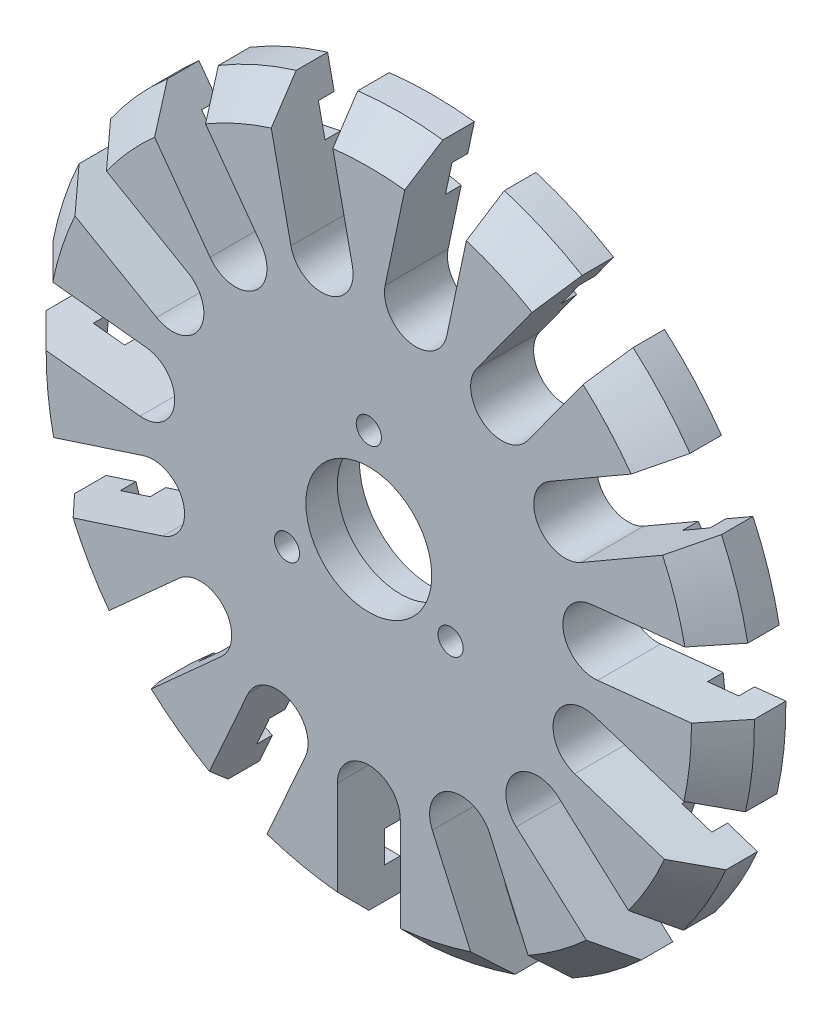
from build123d import *

# Parameters (mm, degrees)
ESBO_O1_R                = 22.5
RESSALTO_EXTRUS_O1_DEPTH = 4
CHANFRO1_SIZE            = 2
CORTE_EXTRUS_O1_DEPTH    = 33.070235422
ESBO_O3_R                = 4
CORTE_EXTRUS_O2_DEPTH    = 33.070235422
ESBO_O4_R                = 4.6
CORTE_EXTRUS_O3_DEPTH    = 2
PADR_OCIRCULAR1_COUNT    = 15
FURO_ROSCADO_DE_M21_D    = 1.6
PADR_OCIRCULAR2_COUNT    = 3
ESBO_O11_W               = 7
ESBO_O11_H               = 2
CORTE_EXTRUS_O4_DEPTH    = 1
PADR_OCIRCULAR3_COUNT    = 15


with BuildPart() as part:
    # Esbo_o1 → Ressalto-extrus_o1 (new body)
    with BuildSketch(Plane.XY):
        Circle(ESBO_O1_R)
    extrude(amount=RESSALTO_EXTRUS_O1_DEPTH)

    # Chanfro1
    chanfro1_edges = [part.edges().sort_by_distance(p)[0] for p in [
        (-22.5, 0, 4),
    ]]
    chamfer(chanfro1_edges, length=CHANFRO1_SIZE)

    # Esbo_o2 → Corte-extrus_o1 (cut, through all)
    with BuildSketch(Plane(origin=(0, 0, 0), x_dir=(-1, 0, 0), z_dir=(0, 0, -1))):
        with BuildLine():
            Line((2, -22.410934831), (2, -14.410934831))
            ThreePointArc((2, -14.410934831), (0, -12.410934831), (-2, -14.410934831))
            Line((-2, -14.410934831), (-2, -22.410934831))
            ThreePointArc((-2, -22.410934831), (0, -22.5), (2, -22.410934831))
        make_face()
    corte_extrus_o1 = extrude(amount=-CORTE_EXTRUS_O1_DEPTH, mode=Mode.SUBTRACT)

    # Esbo_o3 → Corte-extrus_o2 (cut, through all)
    with BuildSketch(Plane(origin=(0, 0, 0), x_dir=(-1, 0, 0), z_dir=(0, 0, -1))):
        Circle(ESBO_O3_R)
    extrude(amount=-CORTE_EXTRUS_O2_DEPTH, mode=Mode.SUBTRACT)

    # Esbo_o4 → Corte-extrus_o3 (cut)
    with BuildSketch(Plane(origin=(0, 0, 0), x_dir=(-1, 0, 0), z_dir=(0, 0, -1))):
        Circle(ESBO_O4_R)
    extrude(amount=-CORTE_EXTRUS_O3_DEPTH, mode=Mode.SUBTRACT)

    # Padr_oCircular1: Corte-extrus_o1 ×15 about axis
    padr_ocircular1_axis = Axis((0, 0, 0), (0, 0, 1))
    for i in range(1, PADR_OCIRCULAR1_COUNT):
        add(corte_extrus_o1.rotate(padr_ocircular1_axis, i * 360 / PADR_OCIRCULAR1_COUNT), mode=Mode.SUBTRACT)

    # Furo roscado de M21 (through all)
    with Locations(Plane(origin=(0, 6, 0), x_dir=(-1, 0, 0), z_dir=(0, 0, -1))):
        with Locations((0, 0)):
            furo_roscado_de_m21 = Hole(FURO_ROSCADO_DE_M21_D / 2)

    # Padr_oCircular2: Furo roscado de M21 ×3 about axis
    padr_ocircular2_axis = Axis((0, 0, 0), (0, 0, 1))
    for i in range(1, PADR_OCIRCULAR2_COUNT):
        add(furo_roscado_de_m21.rotate(padr_ocircular2_axis, i * 360 / PADR_OCIRCULAR2_COUNT), mode=Mode.SUBTRACT)

    # Esbo_o11 → Corte-extrus_o4 (cut)
    with BuildSketch(Plane(origin=(0, 0, 0), x_dir=(-1, 0, 0), z_dir=(0, 0, -1))):
        with Locations((0, -19.410934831)):
            Rectangle(ESBO_O11_W, ESBO_O11_H)
    corte_extrus_o4 = extrude(amount=-CORTE_EXTRUS_O4_DEPTH, mode=Mode.SUBTRACT)

    # Padr_oCircular3: Corte-extrus_o4 ×15 about axis
    padr_ocircular3_axis = Axis((0, 0, 0), (0, 0, 1))
    for i in range(1, PADR_OCIRCULAR3_COUNT):
        add(corte_extrus_o4.rotate(padr_ocircular3_axis, i * 360 / PADR_OCIRCULAR3_COUNT), mode=Mode.SUBTRACT)


solid = part.part
